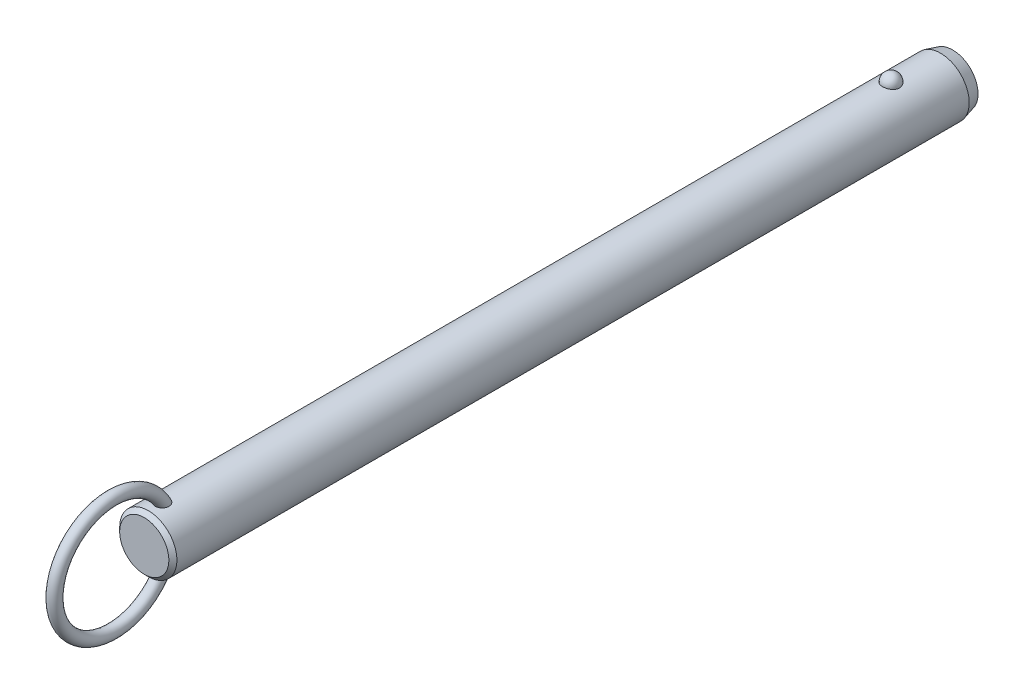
ISO-10303-21;
HEADER;
FILE_DESCRIPTION(('STEP AP214'),'2;1');
FILE_NAME('part.step','',(''),(''),'','','');
FILE_SCHEMA(('AUTOMOTIVE_DESIGN { 1 0 10303 214 1 1 1 1 }'));
ENDSEC;
DATA;
#1=APPLICATION_CONTEXT('core data for automotive mechanical design processes');
#2=APPLICATION_PROTOCOL_DEFINITION('international standard','automotive_design',2000,#1);
#3=PRODUCT_CONTEXT('',#1,'mechanical');
#4=PRODUCT('Part','Part','',(#3));
#5=PRODUCT_RELATED_PRODUCT_CATEGORY('part','',(#4));
#6=PRODUCT_DEFINITION_FORMATION('','',#4);
#7=PRODUCT_DEFINITION_CONTEXT('part definition',#1,'design');
#8=PRODUCT_DEFINITION('design','',#6,#7);
#9=PRODUCT_DEFINITION_SHAPE('','',#8);
#10=(LENGTH_UNIT() NAMED_UNIT(*) SI_UNIT(.MILLI.,.METRE.));
#11=(NAMED_UNIT(*) PLANE_ANGLE_UNIT() SI_UNIT($,.RADIAN.));
#12=(NAMED_UNIT(*) SI_UNIT($,.STERADIAN.) SOLID_ANGLE_UNIT());
#13=UNCERTAINTY_MEASURE_WITH_UNIT(LENGTH_MEASURE(1.E-05),#10,'distance_accuracy_value','');
#14=(GEOMETRIC_REPRESENTATION_CONTEXT(3) GLOBAL_UNCERTAINTY_ASSIGNED_CONTEXT((#13)) GLOBAL_UNIT_ASSIGNED_CONTEXT((#10,
#11,#12)) REPRESENTATION_CONTEXT('',''));
#15=CARTESIAN_POINT('',(0.,0.,0.));
#16=DIRECTION('',(0.,0.,1.));
#17=DIRECTION('',(1.,0.,0.));
#18=AXIS2_PLACEMENT_3D('',#15,#16,#17);
#19=CARTESIAN_POINT('',(0.,0.,175.3));
#20=DIRECTION('',(0.,0.,-1.));
#21=DIRECTION('',(-1.,0.,0.));
#22=AXIS2_PLACEMENT_3D('',#19,#20,#21);
#23=CYLINDRICAL_SURFACE('',#22,7.1);
#24=CARTESIAN_POINT('',(2.0769088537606,6.78943661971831,-2.1));
#25=CARTESIAN_POINT('',(2.07690739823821,6.78943796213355,-1.98268154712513));
#26=CARTESIAN_POINT('',(2.06738130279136,6.79237331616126,-1.86534506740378));
#27=CARTESIAN_POINT('',(2.0295040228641,6.8037853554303,-1.63400788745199));
#28=CARTESIAN_POINT('',(2.00114757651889,6.81226358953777,-1.52000812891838));
#29=CARTESIAN_POINT('',(1.92632025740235,6.83379798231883,-1.29863433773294));
#30=CARTESIAN_POINT('',(1.87985726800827,6.84685214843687,-1.19125744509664));
#31=CARTESIAN_POINT('',(1.76995205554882,6.87608091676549,-0.98604657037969));
#32=CARTESIAN_POINT('',(1.70650980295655,6.8922555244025,-0.88821260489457));
#33=CARTESIAN_POINT('',(1.5638119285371,6.92602930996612,-0.704242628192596));
#34=CARTESIAN_POINT('',(1.4844714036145,6.94363582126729,-0.618173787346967));
#35=CARTESIAN_POINT('',(1.31221746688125,6.97823658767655,-0.460740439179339));
#36=CARTESIAN_POINT('',(1.21930409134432,6.99523084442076,-0.389375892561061));
#37=CARTESIAN_POINT('',(1.02268781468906,7.02666176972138,-0.263547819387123));
#38=CARTESIAN_POINT('',(0.91902009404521,7.04110638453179,-0.209031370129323));
#39=CARTESIAN_POINT('',(0.703548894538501,7.06588726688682,-0.118163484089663));
#40=CARTESIAN_POINT('',(0.591746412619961,7.07622403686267,-0.0818098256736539));
#41=CARTESIAN_POINT('',(0.365557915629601,7.09147068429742,-0.0288711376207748));
#42=CARTESIAN_POINT('',(0.251267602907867,7.09648447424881,-0.0119070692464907));
#43=CARTESIAN_POINT('',(0.0213499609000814,7.10089837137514,0.00304925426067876));
#44=CARTESIAN_POINT('',(-0.0942772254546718,7.10029907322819,0.00104351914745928));
#45=CARTESIAN_POINT('',(-0.321651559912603,7.09360829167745,-0.0216931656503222));
#46=CARTESIAN_POINT('',(-0.433431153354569,7.08760388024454,-0.0421272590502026));
#47=CARTESIAN_POINT('',(-0.651862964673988,7.07086131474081,-0.100729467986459));
#48=CARTESIAN_POINT('',(-0.758515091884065,7.06012307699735,-0.138897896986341));
#49=CARTESIAN_POINT('',(-0.964449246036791,7.03496097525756,-0.232213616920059));
#50=CARTESIAN_POINT('',(-1.06368095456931,7.02051445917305,-0.287465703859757));
#51=CARTESIAN_POINT('',(-1.25145353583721,6.98948740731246,-0.413383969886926));
#52=CARTESIAN_POINT('',(-1.33999321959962,6.97290663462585,-0.48405186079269));
#53=CARTESIAN_POINT('',(-1.50591604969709,6.93898770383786,-0.640594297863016));
#54=CARTESIAN_POINT('',(-1.58302488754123,6.92164094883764,-0.726757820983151));
#55=CARTESIAN_POINT('',(-1.72189320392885,6.8884103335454,-0.91092752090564));
#56=CARTESIAN_POINT('',(-1.78365144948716,6.87252659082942,-1.008934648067));
#57=CARTESIAN_POINT('',(-1.89101272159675,6.84377189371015,-1.21549497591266));
#58=CARTESIAN_POINT('',(-1.93639553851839,6.83094274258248,-1.32416860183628));
#59=CARTESIAN_POINT('',(-2.00874275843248,6.81002070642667,-1.54791500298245));
#60=CARTESIAN_POINT('',(-2.03570774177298,6.80192767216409,-1.66298757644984));
#61=CARTESIAN_POINT('',(-2.07047276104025,6.7914266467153,-1.89571453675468));
#62=CARTESIAN_POINT('',(-2.07835878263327,6.78899315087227,-2.01335491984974));
#63=CARTESIAN_POINT('',(-2.07502083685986,6.79001409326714,-2.24833570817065));
#64=CARTESIAN_POINT('',(-2.06379746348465,6.7934683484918,-2.36567612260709));
#65=CARTESIAN_POINT('',(-2.02263913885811,6.80583442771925,-2.59603194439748));
#66=CARTESIAN_POINT('',(-1.99281127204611,6.81471501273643,-2.70906820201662));
#67=CARTESIAN_POINT('',(-1.91526639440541,6.83691232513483,-2.92836575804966));
#68=CARTESIAN_POINT('',(-1.8675486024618,6.85022924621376,-3.03462676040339));
#69=CARTESIAN_POINT('',(-1.75504492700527,6.87991336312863,-3.23806487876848));
#70=CARTESIAN_POINT('',(-1.69015924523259,6.89629822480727,-3.33518422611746));
#71=CARTESIAN_POINT('',(-1.54505404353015,6.93024852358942,-3.51697105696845));
#72=CARTESIAN_POINT('',(-1.46483385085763,6.94781401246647,-3.60163799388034));
#73=CARTESIAN_POINT('',(-1.29071406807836,6.98225977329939,-3.75654119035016));
#74=CARTESIAN_POINT('',(-1.19675650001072,6.99913673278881,-3.82671308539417));
#75=CARTESIAN_POINT('',(-0.997940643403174,7.03023618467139,-3.9501837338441));
#76=CARTESIAN_POINT('',(-0.89308318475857,7.04445887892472,-4.00348377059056));
#77=CARTESIAN_POINT('',(-0.676902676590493,7.06848365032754,-4.09107242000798));
#78=CARTESIAN_POINT('',(-0.565686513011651,7.0783430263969,-4.12560889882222));
#79=CARTESIAN_POINT('',(-0.338739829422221,7.09282534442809,-4.17575450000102));
#80=CARTESIAN_POINT('',(-0.223009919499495,7.09744899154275,-4.19136617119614));
#81=CARTESIAN_POINT('',(0.00707628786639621,7.10090930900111,-4.20307965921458));
#82=CARTESIAN_POINT('',(0.121410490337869,7.09986531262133,-4.19958377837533));
#83=CARTESIAN_POINT('',(0.347815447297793,7.092380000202,-4.17411564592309));
#84=CARTESIAN_POINT('',(0.459886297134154,7.08593891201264,-4.15214417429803));
#85=CARTESIAN_POINT('',(0.678084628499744,7.06838983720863,-4.09049562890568));
#86=CARTESIAN_POINT('',(0.784237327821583,7.05730369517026,-4.05090137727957));
#87=CARTESIAN_POINT('',(0.988305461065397,7.03163139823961,-3.95511447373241));
#88=CARTESIAN_POINT('',(1.08622031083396,7.01704499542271,-3.89892064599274));
#89=CARTESIAN_POINT('',(1.27284490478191,6.98562668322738,-3.77035541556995));
#90=CARTESIAN_POINT('',(1.36137372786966,6.96876135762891,-3.69772964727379));
#91=CARTESIAN_POINT('',(1.52509486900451,6.93477412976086,-3.53878279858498));
#92=CARTESIAN_POINT('',(1.60028496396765,6.91765218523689,-3.45245943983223));
#93=CARTESIAN_POINT('',(1.73681688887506,6.88465753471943,-3.26658774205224));
#94=CARTESIAN_POINT('',(1.79785966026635,6.86881574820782,-3.16681408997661));
#95=CARTESIAN_POINT('',(1.90265327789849,6.84053157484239,-2.95814408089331));
#96=CARTESIAN_POINT('',(1.94640861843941,6.82808830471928,-2.84925010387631));
#97=CARTESIAN_POINT('',(2.01274378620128,6.80881460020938,-2.63454318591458));
#98=CARTESIAN_POINT('',(2.03676193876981,6.80160856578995,-2.52920574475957));
#99=CARTESIAN_POINT('',(2.06884490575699,6.79191902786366,-2.3159172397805));
#100=CARTESIAN_POINT('',(2.07691019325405,6.78943538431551,-2.20796625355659));
#101=CARTESIAN_POINT('',(2.0769088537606,6.78943661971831,-2.1));
#102=B_SPLINE_CURVE_WITH_KNOTS('',3,(#24,#25,#26,#27,#28,#29,#30,#31,#32,#33,#34,#35,#36,#37,
#38,#39,#40,#41,#42,#43,#44,#45,#46,#47,#48,#49,#50,#51,#52,#53,#54,#55,#56,#57,#58,#59,#60,#61,
#62,#63,#64,#65,#66,#67,#68,#69,#70,#71,#72,#73,#74,#75,#76,#77,#78,#79,#80,#81,#82,#83,#84,#85,
#86,#87,#88,#89,#90,#91,#92,#93,#94,#95,#96,#97,#98,#99,#100,#101),.UNSPECIFIED.,.T.,.F.,(4,2,2,
2,2,2,2,2,2,2,2,2,2,2,2,2,2,2,2,2,2,2,2,2,2,2,2,2,2,2,2,2,2,2,2,2,2,2,4),(0.,0.351568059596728,
0.703234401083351,1.05474780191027,1.40626181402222,1.75970563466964,2.11314851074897,
2.4654696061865,2.81774759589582,3.16301449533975,3.50824481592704,3.84801136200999,
4.18778391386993,4.52968352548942,4.87162112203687,5.22076181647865,5.56993054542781,
5.92363364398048,6.27732559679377,6.62942052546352,6.98150450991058,7.33158042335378,
7.68167162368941,8.03384443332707,8.38603269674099,8.73975272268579,9.09344583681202,
9.44234545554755,9.79119807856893,10.1327344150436,10.4742563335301,10.8141898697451,
11.1541474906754,11.4997793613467,11.8454687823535,12.1979079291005,12.5502553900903,
12.8738073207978,13.1973496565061),.UNSPECIFIED.);
#103=CARTESIAN_POINT('',(2.0769088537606,6.78943661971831,-2.1));
#104=VERTEX_POINT('',#103);
#105=EDGE_CURVE('E41',#104,#104,#102,.T.);
#106=ORIENTED_EDGE('',*,*,#105,.T.);
#107=EDGE_LOOP('',(#106));
#108=FACE_BOUND('',#107,.T.);
#109=CARTESIAN_POINT('',(0.,0.,182.22));
#110=DIRECTION('',(0.,0.,1.));
#111=DIRECTION('',(1.,0.,0.));
#112=AXIS2_PLACEMENT_3D('',#109,#110,#111);
#113=CIRCLE('',#112,7.1);
#114=CARTESIAN_POINT('',(7.1,0.,182.22));
#115=VERTEX_POINT('',#114);
#116=EDGE_CURVE('E10',#115,#115,#113,.F.);
#117=ORIENTED_EDGE('',*,*,#116,.T.);
#118=EDGE_LOOP('',(#117));
#119=FACE_BOUND('',#118,.T.);
#120=CARTESIAN_POINT('',(-0.429539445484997,-7.08699541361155,177.042921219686));
#121=CARTESIAN_POINT('',(-0.508331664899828,-7.08221999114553,177.066876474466));
#122=CARTESIAN_POINT('',(-0.585039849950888,-7.07624016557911,177.097457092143));
#123=CARTESIAN_POINT('',(-0.73208265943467,-7.06254296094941,177.171024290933));
#124=CARTESIAN_POINT('',(-0.802417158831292,-7.05482554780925,177.214011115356));
#125=CARTESIAN_POINT('',(-0.934722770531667,-7.03851844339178,177.311113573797));
#126=CARTESIAN_POINT('',(-0.996700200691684,-7.02992941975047,177.365220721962));
#127=CARTESIAN_POINT('',(-1.11079942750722,-7.01280697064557,177.482967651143));
#128=CARTESIAN_POINT('',(-1.16292136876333,-7.00427354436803,177.546607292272));
#129=CARTESIAN_POINT('',(-1.25705660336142,-6.98799959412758,177.682687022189));
#130=CARTESIAN_POINT('',(-1.29888032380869,-6.98027525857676,177.755259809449));
#131=CARTESIAN_POINT('',(-1.37069920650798,-6.96652886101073,177.906168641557));
#132=CARTESIAN_POINT('',(-1.40069157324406,-6.96050720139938,177.984506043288));
#133=CARTESIAN_POINT('',(-1.45043507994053,-6.95031881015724,178.150190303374));
#134=CARTESIAN_POINT('',(-1.46937115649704,-6.94630231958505,178.237789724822));
#135=CARTESIAN_POINT('',(-1.49424917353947,-6.94099239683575,178.414871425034));
#136=CARTESIAN_POINT('',(-1.50018601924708,-6.93970003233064,178.504354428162));
#137=CARTESIAN_POINT('',(-1.49978214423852,-6.93978815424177,178.694060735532));
#138=CARTESIAN_POINT('',(-1.49187639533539,-6.94150934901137,178.794279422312));
#139=CARTESIAN_POINT('',(-1.46177925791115,-6.94790814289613,178.992479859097));
#140=CARTESIAN_POINT('',(-1.43957541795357,-6.95258831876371,179.090459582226));
#141=CARTESIAN_POINT('',(-1.37783293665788,-6.96510647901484,179.29536292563));
#142=CARTESIAN_POINT('',(-1.33634073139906,-6.97328848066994,179.401680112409));
#143=CARTESIAN_POINT('',(-1.23686994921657,-6.99161706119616,179.606177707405));
#144=CARTESIAN_POINT('',(-1.17889192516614,-7.00176357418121,179.704358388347));
#145=CARTESIAN_POINT('',(-1.0587512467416,-7.02082898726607,179.872374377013));
#146=CARTESIAN_POINT('',(-0.999247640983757,-7.02963746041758,179.944123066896));
#147=CARTESIAN_POINT('',(-0.869494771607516,-7.04686074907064,180.077195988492));
#148=CARTESIAN_POINT('',(-0.799263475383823,-7.05527619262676,180.138537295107));
#149=CARTESIAN_POINT('',(-0.665408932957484,-7.06899457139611,180.235131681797));
#150=CARTESIAN_POINT('',(-0.603817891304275,-7.07457275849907,180.273151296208));
#151=CARTESIAN_POINT('',(-0.475172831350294,-7.08437420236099,180.338758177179));
#152=CARTESIAN_POINT('',(-0.408123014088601,-7.08859848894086,180.366353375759));
#153=CARTESIAN_POINT('',(-0.269431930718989,-7.09522749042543,180.409256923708));
#154=CARTESIAN_POINT('',(-0.197757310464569,-7.09761688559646,180.424461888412));
#155=CARTESIAN_POINT('',(-0.0527849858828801,-7.10017268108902,180.440716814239));
#156=CARTESIAN_POINT('',(0.020511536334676,-7.10034065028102,180.441776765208));
#157=CARTESIAN_POINT('',(0.156426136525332,-7.09855986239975,180.430461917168));
#158=CARTESIAN_POINT('',(0.219199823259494,-7.09688191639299,180.419806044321));
#159=CARTESIAN_POINT('',(0.342134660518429,-7.09201880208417,180.388537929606));
#160=CARTESIAN_POINT('',(0.402295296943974,-7.08883333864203,180.367923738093));
#161=CARTESIAN_POINT('',(0.520687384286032,-7.08113868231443,180.317212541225));
#162=CARTESIAN_POINT('',(0.578791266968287,-7.07658958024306,180.286827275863));
#163=CARTESIAN_POINT('',(0.69017323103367,-7.06659708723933,180.218367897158));
#164=CARTESIAN_POINT('',(0.743447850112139,-7.061153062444,180.180288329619));
#165=CARTESIAN_POINT('',(0.87094790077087,-7.04680292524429,180.076592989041));
#166=CARTESIAN_POINT('',(0.941828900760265,-7.03755800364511,180.006897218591));
#167=CARTESIAN_POINT('',(1.07136606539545,-7.01900793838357,179.856945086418));
#168=CARTESIAN_POINT('',(1.13000013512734,-7.00970271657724,179.776670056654));
#169=CARTESIAN_POINT('',(1.23579584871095,-6.99183327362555,179.606899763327));
#170=CARTESIAN_POINT('',(1.28274271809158,-6.98328455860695,179.517269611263));
#171=CARTESIAN_POINT('',(1.3635144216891,-6.96796352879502,179.332176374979));
#172=CARTESIAN_POINT('',(1.39733971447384,-6.96119115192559,179.236713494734));
#173=CARTESIAN_POINT('',(1.45579181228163,-6.94922464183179,179.02530928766));
#174=CARTESIAN_POINT('',(1.47790145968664,-6.94449000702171,178.908631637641));
#175=CARTESIAN_POINT('',(1.50168752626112,-6.93938731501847,178.673015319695));
#176=CARTESIAN_POINT('',(1.50336085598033,-6.93901991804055,178.55407631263));
#177=CARTESIAN_POINT('',(1.48486516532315,-6.9430010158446,178.32360799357));
#178=CARTESIAN_POINT('',(1.46573441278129,-6.9471253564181,178.211995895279));
#179=CARTESIAN_POINT('',(1.40606892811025,-6.95944667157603,177.994886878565));
#180=CARTESIAN_POINT('',(1.36556446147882,-6.96763788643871,177.8893815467));
#181=CARTESIAN_POINT('',(1.2708270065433,-6.98548038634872,177.704287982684));
#182=CARTESIAN_POINT('',(1.21949810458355,-6.99473841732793,177.623171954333));
#183=CARTESIAN_POINT('',(1.10242050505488,-7.01414069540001,177.472227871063));
#184=CARTESIAN_POINT('',(1.03668119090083,-7.02428436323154,177.40239252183));
#185=CARTESIAN_POINT('',(0.900559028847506,-7.04295285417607,177.283573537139));
#186=CARTESIAN_POINT('',(0.831428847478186,-7.05153466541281,177.233157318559));
#187=CARTESIAN_POINT('',(0.685291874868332,-7.06723150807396,177.145142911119));
#188=CARTESIAN_POINT('',(0.608287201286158,-7.07434693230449,177.107541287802));
#189=CARTESIAN_POINT('',(0.451878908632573,-7.08602232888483,177.047491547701));
#190=CARTESIAN_POINT('',(0.372686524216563,-7.09067127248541,177.024508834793));
#191=CARTESIAN_POINT('',(0.211477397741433,-7.09730788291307,176.992035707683));
#192=CARTESIAN_POINT('',(0.129460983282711,-7.09929585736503,176.98254373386));
#193=CARTESIAN_POINT('',(-0.0332905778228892,-7.10037858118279,176.977351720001));
#194=CARTESIAN_POINT('',(-0.114016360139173,-7.09953334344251,176.981365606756));
#195=CARTESIAN_POINT('',(-0.27367033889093,-7.09517338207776,177.002454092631));
#196=CARTESIAN_POINT('',(-0.352598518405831,-7.09165863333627,177.019528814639));
#197=CARTESIAN_POINT('',(-0.429539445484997,-7.08699541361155,177.042921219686));
#198=B_SPLINE_CURVE_WITH_KNOTS('',3,(#120,#121,#122,#123,#124,#125,#126,#127,#128,#129,#130,
#131,#132,#133,#134,#135,#136,#137,#138,#139,#140,#141,#142,#143,#144,#145,#146,#147,#148,#149,
#150,#151,#152,#153,#154,#155,#156,#157,#158,#159,#160,#161,#162,#163,#164,#165,#166,#167,#168,
#169,#170,#171,#172,#173,#174,#175,#176,#177,#178,#179,#180,#181,#182,#183,#184,#185,#186,#187,
#188,#189,#190,#191,#192,#193,#194,#195,#196,#197),.UNSPECIFIED.,.T.,.F.,(4,2,2,2,2,2,2,2,2,2,2,
2,2,2,2,2,2,2,2,2,2,2,2,2,2,2,2,2,2,2,2,2,2,2,2,2,2,2,4),(0.,0.247183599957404,
0.494372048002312,0.741372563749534,0.988369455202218,1.23962059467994,1.490931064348,
1.75897818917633,2.02713035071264,2.3275826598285,2.62829697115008,2.97008736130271,
3.31186629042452,3.59175319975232,3.87117637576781,4.08813841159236,4.30493502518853,
4.5235225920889,4.74195577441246,4.93215328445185,5.12238804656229,5.318848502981,
5.51544871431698,5.81332317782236,6.11173048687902,6.41527266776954,6.71880423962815,
7.07358156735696,7.42841252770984,7.76631485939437,8.10373999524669,8.39142246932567,
8.67891817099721,8.93560332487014,9.19221962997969,9.43881106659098,9.68537399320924,
9.92674752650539,10.1681233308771),.UNSPECIFIED.);
#199=CARTESIAN_POINT('',(-0.429539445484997,-7.08699541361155,177.042921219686));
#200=VERTEX_POINT('',#199);
#201=EDGE_CURVE('E59',#200,#200,#198,.T.);
#202=ORIENTED_EDGE('',*,*,#201,.T.);
#203=EDGE_LOOP('',(#202));
#204=FACE_BOUND('',#203,.T.);
#205=CARTESIAN_POINT('',(-0.429539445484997,7.08699541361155,177.042921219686));
#206=CARTESIAN_POINT('',(-0.351665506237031,7.09171429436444,177.019246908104));
#207=CARTESIAN_POINT('',(-0.271733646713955,7.09525896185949,177.002036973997));
#208=CARTESIAN_POINT('',(-0.110026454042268,7.09960839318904,176.981005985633));
#209=CARTESIAN_POINT('',(-0.0282502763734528,7.10041187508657,176.977191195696));
#210=CARTESIAN_POINT('',(0.134782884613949,7.09918849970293,176.983059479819));
#211=CARTESIAN_POINT('',(0.216039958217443,7.09716214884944,176.99274013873));
#212=CARTESIAN_POINT('',(0.375730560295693,7.09050177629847,177.025347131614));
#213=CARTESIAN_POINT('',(0.454164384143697,7.08586802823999,177.048272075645));
#214=CARTESIAN_POINT('',(0.606025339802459,7.07449911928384,177.106771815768));
#215=CARTESIAN_POINT('',(0.679451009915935,7.06776334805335,177.142350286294));
#216=CARTESIAN_POINT('',(0.81923414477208,7.05292866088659,177.225175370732));
#217=CARTESIAN_POINT('',(0.885591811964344,7.04482978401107,177.272421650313));
#218=CARTESIAN_POINT('',(1.00993211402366,7.02808709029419,177.377590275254));
#219=CARTESIAN_POINT('',(1.06785399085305,7.01943990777,177.435583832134));
#220=CARTESIAN_POINT('',(1.17342527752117,7.00256662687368,177.560301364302));
#221=CARTESIAN_POINT('',(1.22107408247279,6.99434055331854,177.627025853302));
#222=CARTESIAN_POINT('',(1.30652927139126,6.97889183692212,177.769362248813));
#223=CARTESIAN_POINT('',(1.34399711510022,6.97170674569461,177.845180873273));
#224=CARTESIAN_POINT('',(1.40682616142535,6.95930080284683,178.001810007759));
#225=CARTESIAN_POINT('',(1.43218374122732,6.95408053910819,178.08262200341));
#226=CARTESIAN_POINT('',(1.47246409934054,6.94566853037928,178.253531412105));
#227=CARTESIAN_POINT('',(1.48642590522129,6.9426653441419,178.34386307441));
#228=CARTESIAN_POINT('',(1.5011410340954,6.93949744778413,178.525619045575));
#229=CARTESIAN_POINT('',(1.50188917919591,6.93933385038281,178.617043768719));
#230=CARTESIAN_POINT('',(1.49030464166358,6.94183245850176,178.81084381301));
#231=CARTESIAN_POINT('',(1.47627413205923,6.94486147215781,178.913112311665));
#232=CARTESIAN_POINT('',(1.43356351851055,6.95380194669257,179.114471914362));
#233=CARTESIAN_POINT('',(1.4048676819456,6.95971650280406,179.213559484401));
#234=CARTESIAN_POINT('',(1.32908750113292,6.97461208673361,179.418908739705));
#235=CARTESIAN_POINT('',(1.28011435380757,6.98388945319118,179.524456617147));
#236=CARTESIAN_POINT('',(1.16520357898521,7.00397743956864,179.725760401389));
#237=CARTESIAN_POINT('',(1.09927694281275,7.01478706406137,179.821522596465));
#238=CARTESIAN_POINT('',(0.969361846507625,7.03373936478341,179.976756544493));
#239=CARTESIAN_POINT('',(0.909042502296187,7.04187023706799,180.039303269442));
#240=CARTESIAN_POINT('',(0.779178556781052,7.05741732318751,180.154053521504));
#241=CARTESIAN_POINT('',(0.709649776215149,7.06483472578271,180.206274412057));
#242=CARTESIAN_POINT('',(0.576854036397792,7.0767751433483,180.288113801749));
#243=CARTESIAN_POINT('',(0.515118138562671,7.08158033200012,180.320164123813));
#244=CARTESIAN_POINT('',(0.387127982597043,7.08972701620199,180.373765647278));
#245=CARTESIAN_POINT('',(0.320877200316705,7.09306962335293,180.395324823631));
#246=CARTESIAN_POINT('',(0.185041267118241,7.09791507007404,180.426400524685));
#247=CARTESIAN_POINT('',(0.115437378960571,7.09940591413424,180.435838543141));
#248=CARTESIAN_POINT('',(-0.024315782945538,7.10030171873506,180.441522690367));
#249=CARTESIAN_POINT('',(-0.0944648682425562,7.0997073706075,180.437773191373));
#250=CARTESIAN_POINT('',(-0.225713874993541,7.09668414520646,180.418508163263));
#251=CARTESIAN_POINT('',(-0.287006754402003,7.09444865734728,180.404232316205));
#252=CARTESIAN_POINT('',(-0.406555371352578,7.08860360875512,180.366368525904));
#253=CARTESIAN_POINT('',(-0.464809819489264,7.08499346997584,180.342776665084));
#254=CARTESIAN_POINT('',(-0.594955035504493,7.07541654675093,180.278923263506));
#255=CARTESIAN_POINT('',(-0.665389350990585,7.06906574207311,180.235753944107));
#256=CARTESIAN_POINT('',(-0.798242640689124,7.05530261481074,180.138587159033));
#257=CARTESIAN_POINT('',(-0.860645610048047,7.0478882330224,180.084568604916));
#258=CARTESIAN_POINT('',(-0.994249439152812,7.03045217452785,179.950996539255));
#259=CARTESIAN_POINT('',(-1.06260129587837,7.02030745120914,179.868614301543));
#260=CARTESIAN_POINT('',(-1.18502045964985,7.00068382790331,179.693843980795));
#261=CARTESIAN_POINT('',(-1.23907684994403,6.99120544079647,179.601448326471));
#262=CARTESIAN_POINT('',(-1.33335589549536,6.97384343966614,179.408008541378));
#263=CARTESIAN_POINT('',(-1.37336138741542,6.96598557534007,179.306856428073));
#264=CARTESIAN_POINT('',(-1.43770677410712,6.95299053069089,179.099504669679));
#265=CARTESIAN_POINT('',(-1.46204473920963,6.94785368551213,178.99330440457));
#266=CARTESIAN_POINT('',(-1.49537533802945,6.94076296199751,178.768231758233));
#267=CARTESIAN_POINT('',(-1.50273564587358,6.93914842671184,178.64909751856));
#268=CARTESIAN_POINT('',(-1.4954555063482,6.94072368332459,178.411470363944));
#269=CARTESIAN_POINT('',(-1.48082914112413,6.94391040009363,178.292977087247));
#270=CARTESIAN_POINT('',(-1.43076401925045,6.95438579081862,178.073432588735));
#271=CARTESIAN_POINT('',(-1.39762227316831,6.96121852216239,177.971841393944));
#272=CARTESIAN_POINT('',(-1.31211274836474,6.97783941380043,177.777351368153));
#273=CARTESIAN_POINT('',(-1.25976607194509,6.98762432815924,177.68444313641));
#274=CARTESIAN_POINT('',(-1.14583073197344,7.00713153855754,177.524160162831));
#275=CARTESIAN_POINT('',(-1.08665947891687,7.01665982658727,177.455035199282));
#276=CARTESIAN_POINT('',(-0.956606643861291,7.03556646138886,177.328878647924));
#277=CARTESIAN_POINT('',(-0.885737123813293,7.04494495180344,177.271834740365));
#278=CARTESIAN_POINT('',(-0.7515580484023,7.06035735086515,177.183100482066));
#279=CARTESIAN_POINT('',(-0.690120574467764,7.0666695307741,177.148593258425));
#280=CARTESIAN_POINT('',(-0.562815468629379,7.07794609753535,177.088750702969));
#281=CARTESIAN_POINT('',(-0.496948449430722,7.08291067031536,177.063414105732));
#282=CARTESIAN_POINT('',(-0.429539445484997,7.08699541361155,177.042921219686));
#283=B_SPLINE_CURVE_WITH_KNOTS('',3,(#205,#206,#207,#208,#209,#210,#211,#212,#213,#214,#215,
#216,#217,#218,#219,#220,#221,#222,#223,#224,#225,#226,#227,#228,#229,#230,#231,#232,#233,#234,
#235,#236,#237,#238,#239,#240,#241,#242,#243,#244,#245,#246,#247,#248,#249,#250,#251,#252,#253,
#254,#255,#256,#257,#258,#259,#260,#261,#262,#263,#264,#265,#266,#267,#268,#269,#270,#271,#272,
#273,#274,#275,#276,#277,#278,#279,#280,#281,#282),.UNSPECIFIED.,.T.,.F.,(4,2,2,2,2,2,2,2,2,2,2,
2,2,2,2,2,2,2,2,2,2,2,2,2,2,2,2,2,2,2,2,2,2,2,2,2,2,2,4),(0.,0.244335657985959,
0.488785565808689,0.733191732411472,0.977572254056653,1.22202379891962,1.46646834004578,
1.71259457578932,1.9587352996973,2.21226768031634,2.46587585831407,2.73913816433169,
3.01250754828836,3.32109936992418,3.63002293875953,3.9786351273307,4.32702187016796,
4.58793945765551,4.84841449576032,5.05676704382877,5.26496096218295,5.47449661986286,
5.68396281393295,5.87205447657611,6.06022532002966,6.30743751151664,6.55513496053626,
6.87602468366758,7.19715875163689,7.5230577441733,7.84899686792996,8.20516155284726,
8.56109821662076,8.88040084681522,9.19935367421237,9.47236282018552,9.74509220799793,
9.95662250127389,10.1681235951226),.UNSPECIFIED.);
#284=CARTESIAN_POINT('',(-0.429539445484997,7.08699541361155,177.042921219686));
#285=VERTEX_POINT('',#284);
#286=EDGE_CURVE('E67',#285,#285,#283,.T.);
#287=ORIENTED_EDGE('',*,*,#286,.T.);
#288=EDGE_LOOP('',(#287));
#289=FACE_BOUND('',#288,.T.);
#290=CARTESIAN_POINT('',(0.,0.,-14.4));
#291=DIRECTION('',(0.,0.,-1.));
#292=DIRECTION('',(-1.,0.,0.));
#293=AXIS2_PLACEMENT_3D('',#290,#291,#292);
#294=CIRCLE('',#293,7.1);
#295=CARTESIAN_POINT('',(-7.1,0.,-14.4));
#296=VERTEX_POINT('',#295);
#297=EDGE_CURVE('E56',#296,#296,#294,.F.);
#298=ORIENTED_EDGE('',*,*,#297,.T.);
#299=EDGE_LOOP('',(#298));
#300=FACE_BOUND('',#299,.T.);
#301=ADVANCED_FACE('F37',(#108,#119,#204,#289,#300),#23,.T.);
#302=CARTESIAN_POINT('',(0.,0.,-17.4));
#303=DIRECTION('',(0.,0.,-1.));
#304=DIRECTION('',(-1.,0.,0.));
#305=AXIS2_PLACEMENT_3D('',#302,#303,#304);
#306=PLANE('',#305);
#307=CARTESIAN_POINT('',(0.,0.,-17.4));
#308=DIRECTION('',(0.,0.,-1.));
#309=DIRECTION('',(-1.,0.,0.));
#310=AXIS2_PLACEMENT_3D('',#307,#308,#309);
#311=CIRCLE('',#310,6.29615242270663);
#312=CARTESIAN_POINT('',(-6.29615242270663,0.,-17.4));
#313=VERTEX_POINT('',#312);
#314=EDGE_CURVE('E66',#313,#313,#311,.T.);
#315=ORIENTED_EDGE('',*,*,#314,.T.);
#316=EDGE_LOOP('',(#315));
#317=FACE_BOUND('',#316,.T.);
#318=ADVANCED_FACE('F85',(#317),#306,.T.);
#319=CARTESIAN_POINT('',(0.,0.,-17.4));
#320=DIRECTION('',(0.,0.,1.));
#321=DIRECTION('',(1.,0.,0.));
#322=AXIS2_PLACEMENT_3D('',#319,#320,#321);
#323=CONICAL_SURFACE('',#322,6.29615242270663,0.261799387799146);
#324=ORIENTED_EDGE('',*,*,#297,.F.);
#325=EDGE_LOOP('',(#324));
#326=FACE_BOUND('',#325,.T.);
#327=ORIENTED_EDGE('',*,*,#314,.F.);
#328=EDGE_LOOP('',(#327));
#329=FACE_BOUND('',#328,.T.);
#330=ADVANCED_FACE('F83',(#326,#329),#323,.T.);
#331=CARTESIAN_POINT('',(0.,0.,183.22));
#332=DIRECTION('',(0.,0.,1.));
#333=DIRECTION('',(1.,0.,0.));
#334=AXIS2_PLACEMENT_3D('',#331,#332,#333);
#335=PLANE('',#334);
#336=CARTESIAN_POINT('',(0.,0.,183.22));
#337=DIRECTION('',(0.,0.,1.));
#338=DIRECTION('',(1.,0.,0.));
#339=AXIS2_PLACEMENT_3D('',#336,#337,#338);
#340=CIRCLE('',#339,6.09999999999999);
#341=CARTESIAN_POINT('',(6.09999999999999,0.,183.22));
#342=VERTEX_POINT('',#341);
#343=EDGE_CURVE('E50',#342,#342,#340,.T.);
#344=ORIENTED_EDGE('',*,*,#343,.T.);
#345=EDGE_LOOP('',(#344));
#346=FACE_BOUND('',#345,.T.);
#347=ADVANCED_FACE('F77',(#346),#335,.T.);
#348=CARTESIAN_POINT('',(0.,0.,191.15));
#349=DIRECTION('',(1.,0.,0.));
#350=DIRECTION('',(0.,0.,-1.));
#351=AXIS2_PLACEMENT_3D('',#348,#349,#350);
#352=TOROIDAL_SURFACE('',#351,14.35,1.5);
#353=ORIENTED_EDGE('',*,*,#286,.F.);
#354=EDGE_LOOP('',(#353));
#355=FACE_BOUND('',#354,.T.);
#356=ORIENTED_EDGE('',*,*,#201,.F.);
#357=EDGE_LOOP('',(#356));
#358=FACE_BOUND('',#357,.T.);
#359=ADVANCED_FACE('F73',(#355,#358),#352,.T.);
#360=CARTESIAN_POINT('',(0.,0.,183.22));
#361=DIRECTION('',(0.,0.,-1.));
#362=DIRECTION('',(-1.,0.,0.));
#363=AXIS2_PLACEMENT_3D('',#360,#361,#362);
#364=CONICAL_SURFACE('',#363,6.09999999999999,0.78539816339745);
#365=ORIENTED_EDGE('',*,*,#116,.F.);
#366=EDGE_LOOP('',(#365));
#367=FACE_BOUND('',#366,.T.);
#368=ORIENTED_EDGE('',*,*,#343,.F.);
#369=EDGE_LOOP('',(#368));
#370=FACE_BOUND('',#369,.T.);
#371=ADVANCED_FACE('F39',(#367,#370),#364,.T.);
#372=CARTESIAN_POINT('',(0.,7.1,-2.1));
#373=DIRECTION('',(0.,1.,0.));
#374=DIRECTION('',(0.,0.,1.));
#375=AXIS2_PLACEMENT_3D('',#372,#373,#374);
#376=SPHERICAL_SURFACE('',#375,2.10000000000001);
#377=ORIENTED_EDGE('',*,*,#105,.F.);
#378=EDGE_LOOP('',(#377));
#379=FACE_BOUND('',#378,.T.);
#380=ADVANCED_FACE('F79',(#379),#376,.T.);
#381=CLOSED_SHELL('',(#301,#318,#330,#347,#359,#371,#380));
#382=MANIFOLD_SOLID_BREP('B2',#381);
#383=ADVANCED_BREP_SHAPE_REPRESENTATION('',(#18,#382),#14);
#384=SHAPE_DEFINITION_REPRESENTATION(#9,#383);
ENDSEC;
END-ISO-10303-21;
